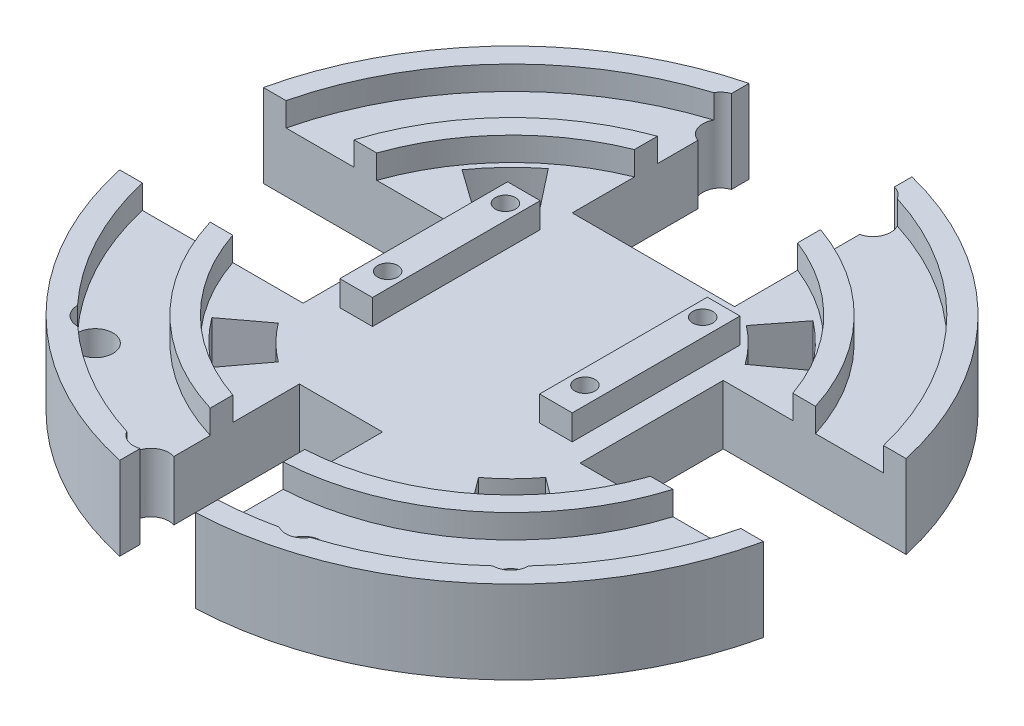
from build123d import *

# Parameters (mm, degrees)
BOSS_EXTRUDE1_DEPTH     = 6.35
SKETCH2_W               = 3.4925
SKETCH2_H               = 17.9451
SKETCH2_R               = 1.0795
BOSS_EXTRUDE2_DEPTH     = 2.6924
SKETCH3_R               = 1.0795
SKETCH3_R_2             = 1.0922
CUT_EXTRUDE1_DEPTH      = 71.058296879
BOSS_EXTRUDE3_DEPTH     = 2.54
CUT_EXTRUDE3_DEPTH      = 71.058296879
CUT_EXTRUDE4_DEPTH      = 71.058296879
CUT_EXTRUDE4_DEPTH_BACK = 71.058296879
SKETCH7_R               = 1.905


with BuildPart() as part:
    # Sketch1 → Boss-Extrude1 (new body)
    with BuildSketch(Plane(origin=(0, 0, 0), x_dir=(1, 0, 0), z_dir=(0, 1, 0))):
        with BuildLine():
            Line((16.1798, 0), (16.1798, -20.007805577))
            ThreePointArc((16.1798, -20.007805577), (37.446534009, -11.810927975), (49.254584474, 7.6835))
            Line((49.254584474, 7.6835), (31.1531, 7.6835))
            Line((31.1531, 7.6835), (29.6291, 7.6835))
            Line((29.6291, 7.6835), (29.6291, 22.9997))
            Line((29.6291, 22.9997), (31.1531, 22.9997))
            Line((31.1531, 22.9997), (49.200887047, 22.9997))
            ThreePointArc((49.200887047, 22.9997), (40.035145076, 39.855290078), (23.39975, 49.414859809))
            Line((23.39975, 49.414859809), (23.39975, 30.4419))
            Line((23.39975, 30.4419), (6.02615, 30.4419))
            Line((6.02615, 30.4419), (6.02615, 49.363198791))
            ThreePointArc((6.02615, 49.363198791), (-10.47918434, 39.780187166), (-19.571787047, 22.9997))
            Line((-19.571787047, 22.9997), (-1.524, 22.9997))
            Line((-1.524, 22.9997), (0, 22.9997))
            Line((0, 22.9997), (0, 7.6835))
            Line((0, 7.6835), (-1.524, 7.6835))
            Line((-1.524, 7.6835), (-19.625484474, 7.6835))
            ThreePointArc((-19.625484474, 7.6835), (-10.110044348, -9.712836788), (7.2898, -19.221861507))
            Line((7.2898, -19.221861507), (7.2898, 0))
            Line((7.2898, 0), (16.1798, 0))
        make_face()
    extrude(amount=BOSS_EXTRUDE1_DEPTH)

    # Sketch2 → Boss-Extrude2 (add)
    # profile 1 of 2: a face of its own
    with BuildSketch(Plane(origin=(0, 6.35, 0), x_dir=(1, 0, 0), z_dir=(0, 1, 0))):
        with Locations((25.5016, 18.1991)):
            Rectangle(SKETCH2_W, SKETCH2_H)
        with Locations(Location((25.36825, 25.06345, 0), (0, 0, 90))):
            Circle(SKETCH2_R, mode=Mode.SUBTRACT)
        with Locations(Location((25.36825, 12.46505, 0), (0, 0, 90))):
            Circle(SKETCH2_R, mode=Mode.SUBTRACT)
    # profile 2 of 2: a face of its own
    with BuildSketch(Plane(origin=(0, 6.35, 0), x_dir=(1, 0, 0), z_dir=(0, 1, 0))):
        with Locations((4.1275, 18.1991)):
            Rectangle(SKETCH2_W, SKETCH2_H)
        with Locations(Location((4.26085, 25.06345, 0), (0, 0, 90))):
            Circle(SKETCH2_R, mode=Mode.SUBTRACT)
        with Locations(Location((4.26085, 12.46505, 0), (0, 0, 90))):
            Circle(SKETCH2_R, mode=Mode.SUBTRACT)
    extrude(amount=BOSS_EXTRUDE2_DEPTH)

    # Sketch3 → Cut-Extrude1 (cut, through all)
    with BuildSketch(Plane(origin=(0, 6.35, 0), x_dir=(1, 0, 0), z_dir=(0, 1, 0))):
        with Locations(Location((25.36825, 25.06345, 0), (0, 0, 90))):
            Circle(SKETCH3_R)
        with Locations(Location((25.36825, 12.46505, 0), (0, 0, 270))):
            Circle(SKETCH3_R_2)
        with Locations(Location((4.26085, 12.46505, 0), (0, 0, 270))):
            Circle(SKETCH3_R_2)
        with Locations(Location((4.26085, 25.06345, 0), (0, 0, 90))):
            Circle(SKETCH3_R)
    extrude(amount=-CUT_EXTRUDE1_DEPTH, mode=Mode.SUBTRACT)

    # Sketch5 → Boss-Extrude3 (add)
    with BuildSketch(Plane(origin=(0, 6.35, 0), x_dir=(1, 0, 0), z_dir=(0, 1, 0))):
        with BuildLine():
            Line((-19.571787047, 22.9997), (-17.145432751, 22.9997))
            ThreePointArc((-17.145432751, 22.9997), (-8.810244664, 38.108032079), (6.02615, 46.918165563))
            Line((6.02615, 46.918165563), (6.02615, 49.363198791))
            ThreePointArc((6.02615, 49.363198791), (-10.47918434, 39.780187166), (-19.571787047, 22.9997))
        make_face()
        with BuildLine():
            Line((6.02615, 37.101674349), (6.02615, 39.565826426))
            ThreePointArc((6.02615, 39.565826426), (-3.860125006, 33.14204082), (-9.871479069, 22.9997))
            Line((-9.871479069, 22.9997), (-7.445124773, 22.9997))
            ThreePointArc((-7.445124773, 22.9997), (-2.235733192, 31.508672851), (6.02615, 37.101674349))
        make_face()
        with BuildLine():
            Line((23.39975, 39.638225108), (23.39975, 37.182197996))
            ThreePointArc((23.39975, 37.182197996), (31.789160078, 31.587522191), (37.074224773, 22.9997))
            Line((37.074224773, 22.9997), (39.500579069, 22.9997))
            ThreePointArc((39.500579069, 22.9997), (33.414383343, 33.219705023), (23.39975, 39.638225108))
        make_face()
        with BuildLine():
            Line((39.575322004, 7.6835), (37.157086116, 7.6835))
            ThreePointArc((37.157086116, 7.6835), (29.116168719, -3.526470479), (16.1798, -8.319189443))
            Line((16.1798, -8.319189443), (16.1798, -10.625617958))
            ThreePointArc((16.1798, -10.625617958), (30.765982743, -5.161904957), (39.575322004, 7.6835))
        make_face()
        with BuildLine():
            Line((7.2898, -9.543684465), (7.2898, -7.125866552))
            ThreePointArc((7.2898, -7.125866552), (-1.8540741, -1.457150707), (-7.527986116, 7.6835))
            Line((-7.527986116, 7.6835), (-9.946222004, 7.6835))
            ThreePointArc((-9.946222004, 7.6835), (-3.482518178, -3.085504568), (7.2898, -9.543684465))
        make_face()
        with BuildLine():
            Line((-19.625484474, 7.6835), (-17.20319971, 7.6835))
            ThreePointArc((-17.20319971, 7.6835), (-8.439700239, -8.042525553), (7.2898, -16.799786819))
            Line((7.2898, -16.799786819), (7.2898, -19.221861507))
            ThreePointArc((7.2898, -19.221861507), (-10.110044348, -9.712836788), (-19.625484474, 7.6835))
        make_face()
        with BuildLine():
            Line((16.1798, -20.007805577), (16.1798, -17.643704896))
            ThreePointArc((16.1798, -17.643704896), (35.766232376, -10.136030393), (46.83229971, 7.6835))
            Line((46.83229971, 7.6835), (49.254584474, 7.6835))
            ThreePointArc((49.254584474, 7.6835), (37.446534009, -11.810927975), (16.1798, -20.007805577))
        make_face()
        with BuildLine():
            Line((46.774532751, 22.9997), (49.200887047, 22.9997))
            ThreePointArc((49.200887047, 22.9997), (40.035145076, 39.855290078), (23.39975, 49.414859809))
            Line((23.39975, 49.414859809), (23.39975, 46.973804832))
            ThreePointArc((23.39975, 46.973804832), (38.365927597, 38.183573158), (46.774532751, 22.9997))
        make_face()
    extrude(amount=BOSS_EXTRUDE3_DEPTH)

    # Sketch6 → Cut-Extrude3 (cut, through all)
    with BuildSketch(Plane(origin=(0, 6.35, 0), x_dir=(1, 0, 0), z_dir=(0, 1, 0))):
        with BuildLine():
            Line((-3.861440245, 28.550108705), (0.273460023, 25.599007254))
            ThreePointArc((0.273460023, 25.599007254), (1.896736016, 27.561025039), (3.782480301, 29.272313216))
            Line((3.782480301, 29.272313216), (0.645404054, 33.26795492))
            ThreePointArc((0.645404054, 33.26795492), (-1.776569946, 31.070045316), (-3.861440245, 28.550108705))
        make_face()
        with BuildLine():
            Line((28.899899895, 33.333431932), (25.781376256, 29.323293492))
            ThreePointArc((25.781376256, 29.323293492), (27.675031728, 27.620763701), (29.307383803, 25.666290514))
            Line((29.307383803, 25.666290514), (33.428561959, 28.636524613))
            ThreePointArc((33.428561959, 28.636524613), (31.332034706, 31.146771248), (28.899899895, 33.333431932))
        make_face()
        with BuildLine():
            Line((29.117558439, 4.51715069), (33.184757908, 1.473421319))
            ThreePointArc((33.184757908, 1.473421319), (31.043510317, -0.998788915), (28.572517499, -3.141441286))
            Line((28.572517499, -3.141441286), (25.526476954, 0.924027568))
            ThreePointArc((25.526476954, 0.924027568), (27.450387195, 2.592292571), (29.117558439, 4.51715069))
        make_face()
        with BuildLine():
            Line((4.11075069, 0.917941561), (1.067021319, -3.149257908))
            ThreePointArc((1.067021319, -3.149257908), (-1.405188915, -1.008010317), (-3.547841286, 1.462982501))
            Line((-3.547841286, 1.462982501), (0.517627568, 4.509023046))
            ThreePointArc((0.517627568, 4.509023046), (2.185892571, 2.585112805), (4.11075069, 0.917941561))
        make_face()
    extrude(amount=-CUT_EXTRUDE3_DEPTH, mode=Mode.SUBTRACT)

    # Sketch7 → Cut-Extrude4 (cut, two sides: drawn at the far end of the back side and taken through both)
    with BuildSketch(Plane(origin=(0, 6.35, 0), x_dir=(1, 0, 0), z_dir=(0, 1, 0)).offset(-CUT_EXTRUDE4_DEPTH_BACK)):
        with Locations((6.66115, 45.682754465)):
            Circle(SKETCH7_R)
        with Locations((22.96795, 45.682754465)):
            Circle(SKETCH7_R)
        with Locations(Location((-7.4168, -7.143453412, 0), (0, 0, 270))):
            Circle(SKETCH7_R)
        with Locations((6.66115, -15.240854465)):
            Circle(SKETCH7_R)
        with Locations(Location((22.96795, -15.240854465, 0), (0, 0, 270))):
            Circle(SKETCH7_R)
        with Locations(Location((37.0459, -7.143453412, 0), (0, 0, 270))):
            Circle(SKETCH7_R)
    extrude(amount=CUT_EXTRUDE4_DEPTH + CUT_EXTRUDE4_DEPTH_BACK, mode=Mode.SUBTRACT)


solid = part.part
